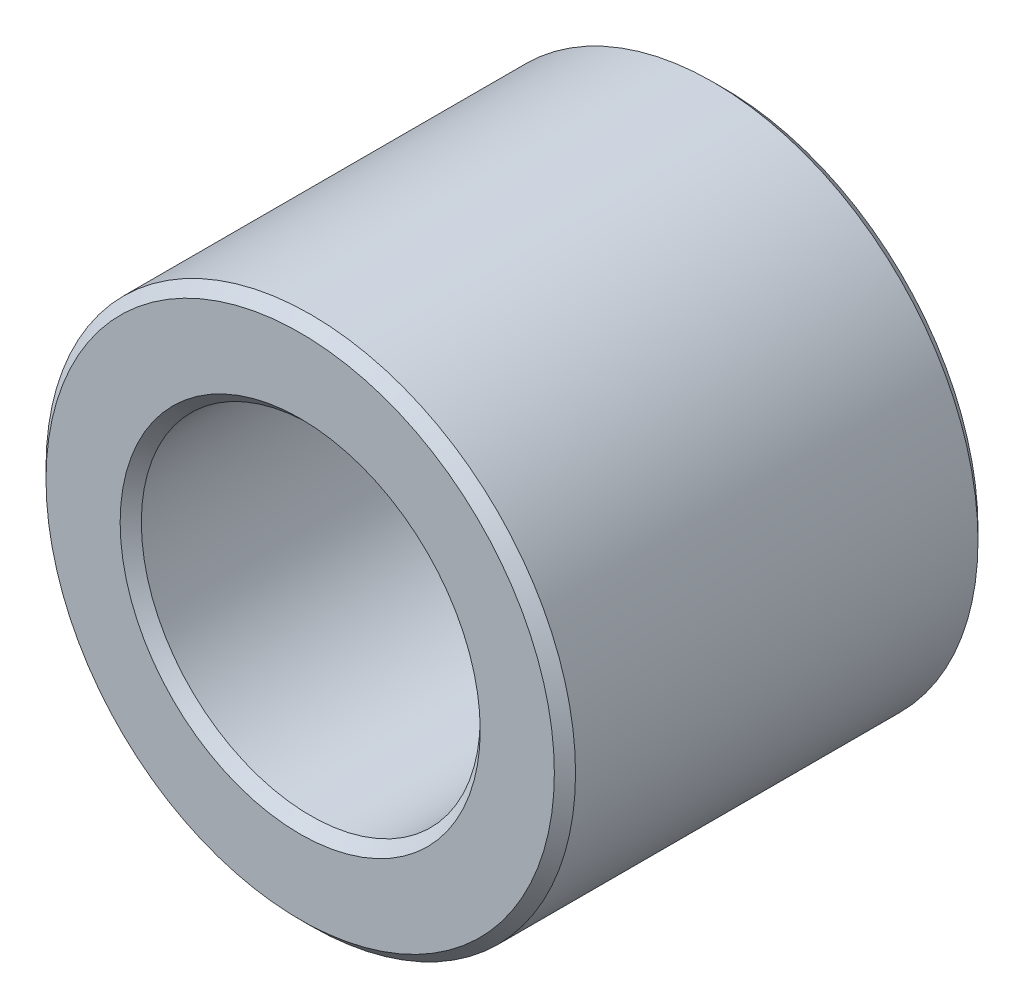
from build123d import *

# Parameters (mm, degrees)
SKETCH1_R           = 5
SKETCH1_R_2         = 3.2
BOSS_EXTRUDE2_DEPTH = 4
CHAMFER3_SIZE       = 0.2


with BuildPart() as part:
    # Sketch1 → Boss-Extrude2 (new, symmetric)
    with BuildSketch(Plane.XY):
        Circle(SKETCH1_R)
        Circle(SKETCH1_R_2, mode=Mode.SUBTRACT)
    extrude(amount=BOSS_EXTRUDE2_DEPTH, both=True)

    # Chamfer3
    chamfer3_edges = [part.edges().sort_by_distance(p)[0] for p in [
        (-5, 0, -4),
        (-5, 0, 4),
        (-3.2, 0, -4),
        (-3.2, 0, 4),
    ]]
    chamfer(chamfer3_edges, length=CHAMFER3_SIZE)


solid = part.part
